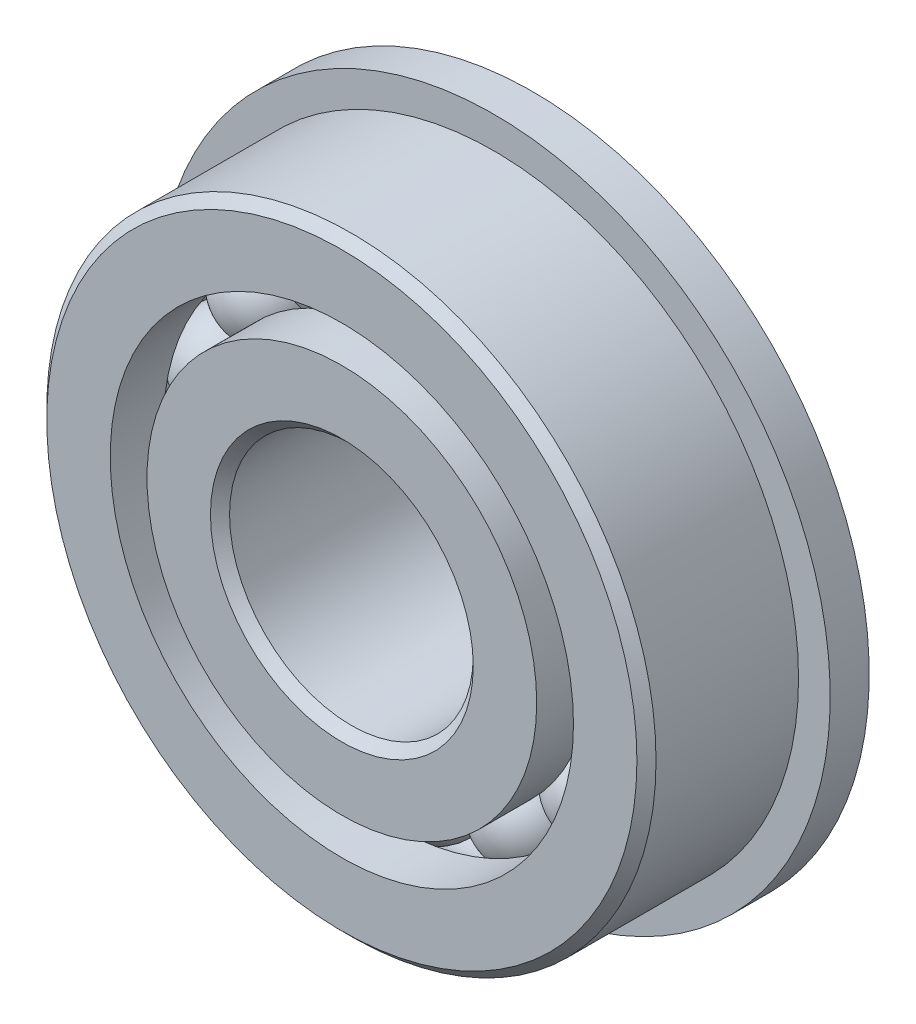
from build123d import *

# Parameters (mm, degrees)
SKETCH5_W         = 1.016
SKETCH5_H         = 1.901099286
CIRPATTERN1_COUNT = 14


with BuildPart() as part:
    # Sketch1 → Revolve1 (revolve)
    with BuildSketch(Plane(origin=(0, 0, 0), x_dir=(0, 0, -1), z_dir=(1, 0, 0)), mode=Mode.PRIVATE) as revolve1_sk:
        with BuildLine():
            Line((2.24028, 7.9375), (-2.24028, 7.9375))
            Line((-2.24028, 7.9375), (-2.4892, 7.68858))
            Line((-2.4892, 7.68858), (-2.4892, 6.035221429))
            Line((-2.4892, 6.035221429), (-1.106311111, 6.035221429))
            ThreePointArc((-1.106311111, 6.035221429), (0, 6.76179465), (1.106311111, 6.035221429))
            Line((1.106311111, 6.035221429), (2.4892, 6.035221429))
            Line((2.4892, 6.035221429), (2.4892, 7.68858))
            Line((2.4892, 7.68858), (2.24028, 7.9375))
        make_face()
    revolve(revolve1_sk.sketch.rotate(Axis((0, 0, 2.4892), (0, 0, -1)), 90), axis=Axis((0, 0, 2.4892), (0, 0, -1)))

    # Sketch5 → Revolve5 (revolve)
    with BuildSketch(Plane(origin=(0, 0, 0), x_dir=(0, 0, -1), z_dir=(1, 0, 0)), mode=Mode.PRIVATE) as revolve5_sk:
        with Locations((1.9812, 7.812450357)):
            Rectangle(SKETCH5_W, SKETCH5_H)
    revolve(revolve5_sk.sketch.rotate(Axis((0, 0, -2.4892), (0, 0, 1)), 270), axis=Axis((0, 0, -2.4892), (0, 0, 1)))


with BuildPart() as body_2:
    # Sketch3 → Revolve3 (revolve)
    with BuildSketch(Plane(origin=(0, 0, 0), x_dir=(0, 0, -1), z_dir=(1, 0, 0)), mode=Mode.PRIVATE) as revolve3_sk:
        with BuildLine():
            Line((-1.106311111, 5.077278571), (-2.4892, 5.077278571))
            Line((-2.4892, 5.077278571), (-2.4892, 3.42392))
            Line((-2.4892, 3.42392), (-2.24028, 3.175))
            Line((-2.24028, 3.175), (2.24028, 3.175))
            Line((2.24028, 3.175), (2.4892, 3.42392))
            Line((2.4892, 3.42392), (2.4892, 5.077278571))
            Line((2.4892, 5.077278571), (1.106311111, 5.077278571))
            ThreePointArc((1.106311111, 5.077278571), (0, 4.35070535), (-1.106311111, 5.077278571))
        make_face()
    revolve(revolve3_sk.sketch.rotate(Axis((0, 0, 2.4892), (0, 0, -1)), 90), axis=Axis((0, 0, 2.4892), (0, 0, -1)))


with BuildPart() as body_3:
    # Sketch4 → Revolve4 (revolve)
    with BuildSketch(Plane(origin=(0, 0, 0), x_dir=(0, 0, -1), z_dir=(1, 0, 0))):
        with BuildLine():
            Line((-1.20554465, 5.55625), (1.20554465, 5.55625))
            ThreePointArc((1.20554465, 5.55625), (0, 6.76179465), (-1.20554465, 5.55625))
        make_face()
    revolve(axis=Axis((0, 5.55625, 1.20554465), (0, 0, -1)))


with BuildPart() as cirpattern1_1:
    # CirPattern1: pattern copy
    add(body_3.part.rotate(Axis((0, 0, 0), (0, 0, 1)), 1 * 360 / CIRPATTERN1_COUNT))


with BuildPart() as cirpattern1_2:
    # CirPattern1: pattern copy
    add(body_3.part.rotate(Axis((0, 0, 0), (0, 0, 1)), 2 * 360 / CIRPATTERN1_COUNT))


with BuildPart() as cirpattern1_3:
    # CirPattern1: pattern copy
    add(body_3.part.rotate(Axis((0, 0, 0), (0, 0, 1)), 3 * 360 / CIRPATTERN1_COUNT))


with BuildPart() as cirpattern1_4:
    # CirPattern1: pattern copy
    add(body_3.part.rotate(Axis((0, 0, 0), (0, 0, 1)), 4 * 360 / CIRPATTERN1_COUNT))


with BuildPart() as cirpattern1_5:
    # CirPattern1: pattern copy
    add(body_3.part.rotate(Axis((0, 0, 0), (0, 0, 1)), 5 * 360 / CIRPATTERN1_COUNT))


with BuildPart() as cirpattern1_6:
    # CirPattern1: pattern copy
    add(body_3.part.rotate(Axis((0, 0, 0), (0, 0, 1)), 6 * 360 / CIRPATTERN1_COUNT))


with BuildPart() as cirpattern1_7:
    # CirPattern1: pattern copy
    add(body_3.part.rotate(Axis((0, 0, 0), (0, 0, 1)), 7 * 360 / CIRPATTERN1_COUNT))


with BuildPart() as cirpattern1_8:
    # CirPattern1: pattern copy
    add(body_3.part.rotate(Axis((0, 0, 0), (0, 0, 1)), 8 * 360 / CIRPATTERN1_COUNT))


with BuildPart() as cirpattern1_9:
    # CirPattern1: pattern copy
    add(body_3.part.rotate(Axis((0, 0, 0), (0, 0, 1)), 9 * 360 / CIRPATTERN1_COUNT))


with BuildPart() as cirpattern1_10:
    # CirPattern1: pattern copy
    add(body_3.part.rotate(Axis((0, 0, 0), (0, 0, 1)), 10 * 360 / CIRPATTERN1_COUNT))


with BuildPart() as cirpattern1_11:
    # CirPattern1: pattern copy
    add(body_3.part.rotate(Axis((0, 0, 0), (0, 0, 1)), 11 * 360 / CIRPATTERN1_COUNT))


with BuildPart() as cirpattern1_12:
    # CirPattern1: pattern copy
    add(body_3.part.rotate(Axis((0, 0, 0), (0, 0, 1)), 12 * 360 / CIRPATTERN1_COUNT))


with BuildPart() as cirpattern1_13:
    # CirPattern1: pattern copy
    add(body_3.part.rotate(Axis((0, 0, 0), (0, 0, 1)), 13 * 360 / CIRPATTERN1_COUNT))


solid = Compound([part.part, body_2.part, body_3.part, cirpattern1_1.part, cirpattern1_2.part, cirpattern1_3.part, cirpattern1_4.part, cirpattern1_5.part, cirpattern1_6.part, cirpattern1_7.part, cirpattern1_8.part, cirpattern1_9.part, cirpattern1_10.part, cirpattern1_11.part, cirpattern1_12.part, cirpattern1_13.part])
